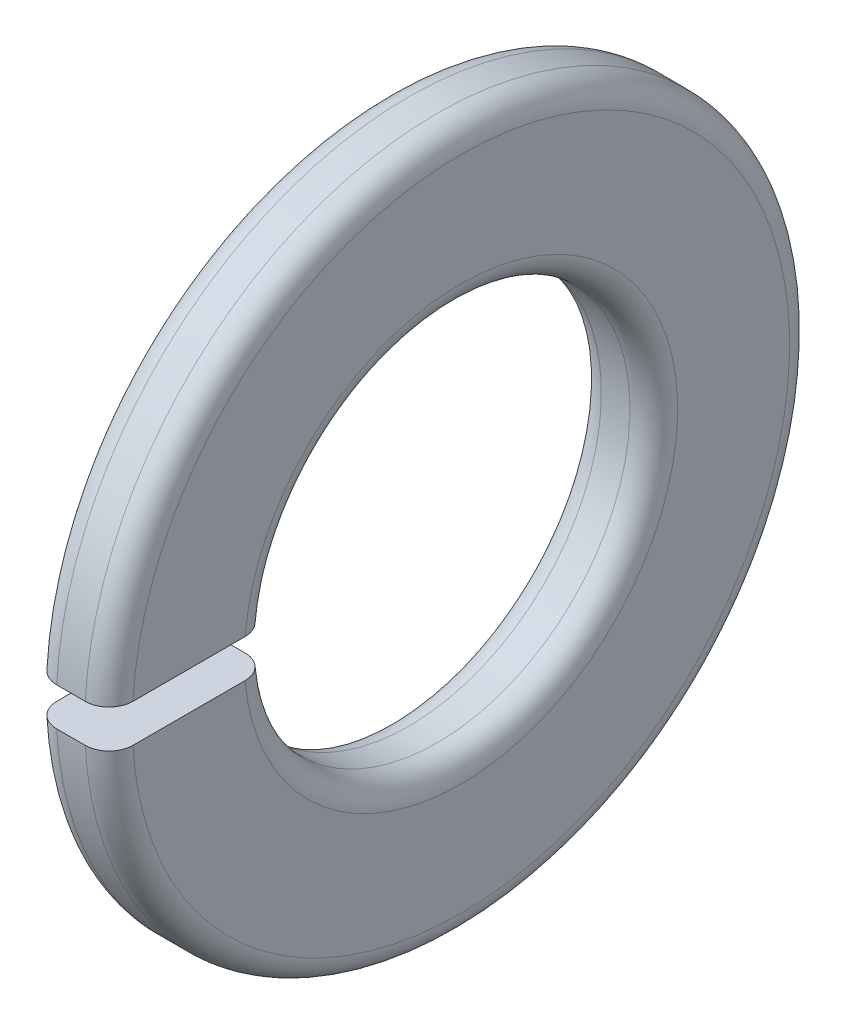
ISO-10303-21;
HEADER;
FILE_DESCRIPTION(('STEP AP214'),'2;1');
FILE_NAME('part.step','',(''),(''),'','','');
FILE_SCHEMA(('AUTOMOTIVE_DESIGN { 1 0 10303 214 1 1 1 1 }'));
ENDSEC;
DATA;
#1=APPLICATION_CONTEXT('core data for automotive mechanical design processes');
#2=APPLICATION_PROTOCOL_DEFINITION('international standard','automotive_design',2000,#1);
#3=PRODUCT_CONTEXT('',#1,'mechanical');
#4=PRODUCT('Part','Part','',(#3));
#5=PRODUCT_RELATED_PRODUCT_CATEGORY('part','',(#4));
#6=PRODUCT_DEFINITION_FORMATION('','',#4);
#7=PRODUCT_DEFINITION_CONTEXT('part definition',#1,'design');
#8=PRODUCT_DEFINITION('design','',#6,#7);
#9=PRODUCT_DEFINITION_SHAPE('','',#8);
#10=(LENGTH_UNIT() NAMED_UNIT(*) SI_UNIT(.MILLI.,.METRE.));
#11=(NAMED_UNIT(*) PLANE_ANGLE_UNIT() SI_UNIT($,.RADIAN.));
#12=(NAMED_UNIT(*) SI_UNIT($,.STERADIAN.) SOLID_ANGLE_UNIT());
#13=UNCERTAINTY_MEASURE_WITH_UNIT(LENGTH_MEASURE(1.E-05),#10,'distance_accuracy_value','');
#14=(GEOMETRIC_REPRESENTATION_CONTEXT(3) GLOBAL_UNCERTAINTY_ASSIGNED_CONTEXT((#13)) GLOBAL_UNIT_ASSIGNED_CONTEXT((#10,
#11,#12)) REPRESENTATION_CONTEXT('',''));
#15=CARTESIAN_POINT('',(0.,0.,0.));
#16=DIRECTION('',(0.,0.,1.));
#17=DIRECTION('',(1.,0.,0.));
#18=AXIS2_PLACEMENT_3D('',#15,#16,#17);
#19=CARTESIAN_POINT('',(-34.9249999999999,0.,0.));
#20=DIRECTION('',(-1.,0.,0.));
#21=DIRECTION('',(0.,0.,1.));
#22=AXIS2_PLACEMENT_3D('',#19,#20,#21);
#23=CYLINDRICAL_SURFACE('',#22,7.4);
#24=DIRECTION('',(-1.,0.,0.));
#25=VECTOR('',#24,1.);
#26=CARTESIAN_POINT('',(-34.9249999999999,0.4,7.38918128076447));
#27=LINE('',#26,#25);
#28=CARTESIAN_POINT('',(-0.5,0.4,7.38918128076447));
#29=VERTEX_POINT('',#28);
#30=CARTESIAN_POINT('',(-1.1,0.4,7.38918128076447));
#31=VERTEX_POINT('',#30);
#32=EDGE_CURVE('E189',#29,#31,#27,.T.);
#33=ORIENTED_EDGE('',*,*,#32,.F.);
#34=CARTESIAN_POINT('',(-0.5,0.,0.));
#35=DIRECTION('',(-1.,0.,0.));
#36=DIRECTION('',(0.,0.,1.));
#37=AXIS2_PLACEMENT_3D('',#34,#35,#36);
#38=CIRCLE('',#37,7.4);
#39=CARTESIAN_POINT('',(-0.5,-0.4,7.38918128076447));
#40=VERTEX_POINT('',#39);
#41=EDGE_CURVE('E137',#29,#40,#38,.T.);
#42=ORIENTED_EDGE('',*,*,#41,.T.);
#43=DIRECTION('',(-1.,0.,0.));
#44=VECTOR('',#43,1.);
#45=CARTESIAN_POINT('',(-34.9249999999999,-0.4,7.38918128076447));
#46=LINE('',#45,#44);
#47=CARTESIAN_POINT('',(-1.1,-0.4,7.38918128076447));
#48=VERTEX_POINT('',#47);
#49=EDGE_CURVE('E120',#48,#40,#46,.F.);
#50=ORIENTED_EDGE('',*,*,#49,.F.);
#51=CARTESIAN_POINT('',(-1.1,0.,0.));
#52=DIRECTION('',(1.,0.,0.));
#53=DIRECTION('',(0.,0.,-1.));
#54=AXIS2_PLACEMENT_3D('',#51,#52,#53);
#55=CIRCLE('',#54,7.4);
#56=EDGE_CURVE('E135',#48,#31,#55,.T.);
#57=ORIENTED_EDGE('',*,*,#56,.T.);
#58=EDGE_LOOP('',(#33,#42,#50,#57));
#59=FACE_BOUND('',#58,.T.);
#60=ADVANCED_FACE('F37',(#59),#23,.T.);
#61=CARTESIAN_POINT('',(0.,4.55,0.));
#62=DIRECTION('',(-1.,0.,0.));
#63=DIRECTION('',(0.,0.,1.));
#64=AXIS2_PLACEMENT_3D('',#61,#62,#63);
#65=PLANE('',#64);
#66=DIRECTION('',(0.,0.,1.));
#67=VECTOR('',#66,1.);
#68=CARTESIAN_POINT('',(0.,-0.4,0.));
#69=LINE('',#68,#67);
#70=CARTESIAN_POINT('',(0.,-0.4,4.53238347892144));
#71=VERTEX_POINT('',#70);
#72=CARTESIAN_POINT('',(0.,-0.4,6.88839603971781));
#73=VERTEX_POINT('',#72);
#74=EDGE_CURVE('E101',#71,#73,#69,.T.);
#75=ORIENTED_EDGE('',*,*,#74,.T.);
#76=CARTESIAN_POINT('',(0.,0.,0.));
#77=DIRECTION('',(-1.,0.,0.));
#78=DIRECTION('',(0.,0.,1.));
#79=AXIS2_PLACEMENT_3D('',#76,#77,#78);
#80=CIRCLE('',#79,6.9);
#81=CARTESIAN_POINT('',(0.,0.4,6.88839603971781));
#82=VERTEX_POINT('',#81);
#83=EDGE_CURVE('E59',#73,#82,#80,.F.);
#84=ORIENTED_EDGE('',*,*,#83,.T.);
#85=DIRECTION('',(0.,0.,-1.));
#86=VECTOR('',#85,1.);
#87=CARTESIAN_POINT('',(0.,0.4,7.548));
#88=LINE('',#87,#86);
#89=CARTESIAN_POINT('',(0.,0.4,4.53238347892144));
#90=VERTEX_POINT('',#89);
#91=EDGE_CURVE('E110',#82,#90,#88,.T.);
#92=ORIENTED_EDGE('',*,*,#91,.T.);
#93=CARTESIAN_POINT('',(0.,0.,0.));
#94=DIRECTION('',(-1.,0.,0.));
#95=DIRECTION('',(0.,0.,1.));
#96=AXIS2_PLACEMENT_3D('',#93,#94,#95);
#97=CIRCLE('',#96,4.55);
#98=EDGE_CURVE('E117',#90,#71,#97,.T.);
#99=ORIENTED_EDGE('',*,*,#98,.T.);
#100=EDGE_LOOP('',(#75,#84,#92,#99));
#101=FACE_BOUND('',#100,.T.);
#102=ADVANCED_FACE('F123',(#101),#65,.F.);
#103=CARTESIAN_POINT('',(-0.5,0.,0.));
#104=DIRECTION('',(-1.,0.,0.));
#105=DIRECTION('',(0.,0.,1.));
#106=AXIS2_PLACEMENT_3D('',#103,#104,#105);
#107=TOROIDAL_SURFACE('',#106,4.55,0.5);
#108=ORIENTED_EDGE('',*,*,#98,.F.);
#109=CARTESIAN_POINT('',(-0.330409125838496,0.4,4.05998263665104));
#110=CARTESIAN_POINT('',(-0.356699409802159,0.4,4.05045896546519));
#111=CARTESIAN_POINT('',(-0.383811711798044,0.4,4.04314572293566));
#112=CARTESIAN_POINT('',(-0.43890146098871,0.4,4.0331697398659));
#113=CARTESIAN_POINT('',(-0.466879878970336,0.4,4.03051242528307));
#114=CARTESIAN_POINT('',(-0.522875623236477,0.4,4.02993732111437));
#115=CARTESIAN_POINT('',(-0.550892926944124,0.4,4.0320174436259));
#116=CARTESIAN_POINT('',(-0.606172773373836,0.4,4.04085230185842));
#117=CARTESIAN_POINT('',(-0.633435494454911,0.4,4.04760592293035));
#118=CARTESIAN_POINT('',(-0.686443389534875,0.4,4.06558912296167));
#119=CARTESIAN_POINT('',(-0.712188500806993,0.4,4.07681888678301));
#120=CARTESIAN_POINT('',(-0.761436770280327,0.4,4.10342912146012));
#121=CARTESIAN_POINT('',(-0.784939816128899,0.4,4.11880980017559));
#122=CARTESIAN_POINT('',(-0.829113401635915,0.4,4.1533315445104));
#123=CARTESIAN_POINT('',(-0.849775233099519,0.4,4.17248375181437));
#124=CARTESIAN_POINT('',(-0.8876079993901,0.4,4.21397126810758));
#125=CARTESIAN_POINT('',(-0.904778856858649,0.4,4.23630664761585));
#126=CARTESIAN_POINT('',(-0.93522366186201,0.4,4.28363431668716));
#127=CARTESIAN_POINT('',(-0.948479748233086,0.4,4.30863809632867));
#128=CARTESIAN_POINT('',(-0.970623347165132,0.4,4.36051051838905));
#129=CARTESIAN_POINT('',(-0.979510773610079,0.4,4.38737919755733));
#130=CARTESIAN_POINT('',(-0.992694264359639,0.4,4.44232245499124));
#131=CARTESIAN_POINT('',(-0.996973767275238,0.4,4.4704010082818));
#132=CARTESIAN_POINT('',(-1.00076411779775,0.4,4.52687835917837));
#133=CARTESIAN_POINT('',(-1.0002749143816,0.4,4.55527716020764));
#134=CARTESIAN_POINT('',(-0.994535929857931,0.4,4.61162260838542));
#135=CARTESIAN_POINT('',(-0.989280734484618,0.4,4.63956870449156));
#136=CARTESIAN_POINT('',(-0.974146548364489,0.4,4.69417974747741));
#137=CARTESIAN_POINT('',(-0.96426758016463,0.4,4.72084470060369));
#138=CARTESIAN_POINT('',(-0.940178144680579,0.4,4.77209438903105));
#139=CARTESIAN_POINT('',(-0.925973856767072,0.4,4.79668202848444));
#140=CARTESIAN_POINT('',(-0.893627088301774,0.4,4.84311401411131));
#141=CARTESIAN_POINT('',(-0.875484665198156,0.4,4.8649584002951));
#142=CARTESIAN_POINT('',(-0.835834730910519,0.4,4.90521248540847));
#143=CARTESIAN_POINT('',(-0.814337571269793,0.4,4.92363238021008));
#144=CARTESIAN_POINT('',(-0.768547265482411,0.4,4.95658736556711));
#145=CARTESIAN_POINT('',(-0.744254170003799,0.4,4.97112252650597));
#146=CARTESIAN_POINT('',(-0.693647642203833,0.4,4.99584577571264));
#147=CARTESIAN_POINT('',(-0.667341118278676,0.4,5.00604800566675));
#148=CARTESIAN_POINT('',(-0.613386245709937,0.4,5.02187927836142));
#149=CARTESIAN_POINT('',(-0.585737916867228,0.4,5.0275083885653));
#150=CARTESIAN_POINT('',(-0.529954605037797,0.4,5.03402249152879));
#151=CARTESIAN_POINT('',(-0.501820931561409,0.4,5.03491870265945));
#152=CARTESIAN_POINT('',(-0.445803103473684,0.4,5.03197138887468));
#153=CARTESIAN_POINT('',(-0.417918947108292,0.4,5.0281278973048));
#154=CARTESIAN_POINT('',(-0.363212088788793,0.4,5.01581674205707));
#155=CARTESIAN_POINT('',(-0.336388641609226,0.4,5.00735238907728));
#156=CARTESIAN_POINT('',(-0.284541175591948,0.4,4.98604553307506));
#157=CARTESIAN_POINT('',(-0.259517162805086,0.4,4.97320301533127));
#158=CARTESIAN_POINT('',(-0.211946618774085,0.4,4.94349125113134));
#159=CARTESIAN_POINT('',(-0.189402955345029,0.4,4.92661741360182));
#160=CARTESIAN_POINT('',(-0.147459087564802,0.4,4.88933373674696));
#161=CARTESIAN_POINT('',(-0.128058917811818,0.4,4.86892385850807));
#162=CARTESIAN_POINT('',(-0.092896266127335,0.4,4.82509033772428));
#163=CARTESIAN_POINT('',(-0.0771436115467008,0.4,4.8016588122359));
#164=CARTESIAN_POINT('',(-0.0497804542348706,0.4,4.75249065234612));
#165=CARTESIAN_POINT('',(-0.0381700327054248,0.4,4.72675397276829));
#166=CARTESIAN_POINT('',(-0.0193802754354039,0.4,4.67361422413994));
#167=CARTESIAN_POINT('',(-0.0122158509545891,0.4,4.64620588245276));
#168=CARTESIAN_POINT('',(-0.00257598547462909,0.4,4.59057656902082));
#169=CARTESIAN_POINT('',(-0.000100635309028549,0.4,4.56235558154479));
#170=CARTESIAN_POINT('',(9.48808271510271E-05,0.4,4.50581794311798));
#171=CARTESIAN_POINT('',(-0.00219827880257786,0.4,4.47750124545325));
#172=CARTESIAN_POINT('',(-0.0115011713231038,0.4,4.42165438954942));
#173=CARTESIAN_POINT('',(-0.0185107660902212,0.4,4.39412420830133));
#174=CARTESIAN_POINT('',(-0.0370577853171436,0.4,4.3406085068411));
#175=CARTESIAN_POINT('',(-0.0485988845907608,0.4,4.31462426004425));
#176=CARTESIAN_POINT('',(-0.0758904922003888,0.4,4.26495974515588));
#177=CARTESIAN_POINT('',(-0.0916420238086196,0.4,4.2412800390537));
#178=CARTESIAN_POINT('',(-0.12688551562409,0.4,4.19694238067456));
#179=CARTESIAN_POINT('',(-0.146372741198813,0.4,4.17628066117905));
#180=CARTESIAN_POINT('',(-0.188537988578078,0.4,4.13855872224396));
#181=CARTESIAN_POINT('',(-0.211212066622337,0.4,4.12149411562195));
#182=CARTESIAN_POINT('',(-0.250142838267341,0.4,4.09706335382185));
#183=CARTESIAN_POINT('',(-0.265634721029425,0.4,4.08845497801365));
#184=CARTESIAN_POINT('',(-0.297444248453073,0.4,4.07292985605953));
#185=CARTESIAN_POINT('',(-0.313761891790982,0.4,4.06601310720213));
#186=CARTESIAN_POINT('',(-0.330409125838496,0.4,4.05998263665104));
#187=B_SPLINE_CURVE_WITH_KNOTS('',3,(#109,#110,#111,#112,#113,#114,#115,#116,#117,#118,#119,
#120,#121,#122,#123,#124,#125,#126,#127,#128,#129,#130,#131,#132,#133,#134,#135,#136,#137,#138,
#139,#140,#141,#142,#143,#144,#145,#146,#147,#148,#149,#150,#151,#152,#153,#154,#155,#156,#157,
#158,#159,#160,#161,#162,#163,#164,#165,#166,#167,#168,#169,#170,#171,#172,#173,#174,#175,#176,
#177,#178,#179,#180,#181,#182,#183,#184,#185,#186),.UNSPECIFIED.,.T.,.F.,(4,2,2,2,2,2,2,2,2,2,2,
2,2,2,2,2,2,2,2,2,2,2,2,2,2,2,2,2,2,2,2,2,2,2,2,2,2,2,4),(0.,0.0838218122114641,
0.167741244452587,0.251623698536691,0.335486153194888,0.41935207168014,0.503222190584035,
0.587343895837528,0.671467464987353,0.755969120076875,0.840472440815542,0.92527847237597,
1.0100854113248,1.09498881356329,1.17989180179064,1.26467405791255,1.34945507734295,
1.43397948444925,1.51850236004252,1.60274721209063,1.68699082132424,1.77103465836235,
1.85507790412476,1.93906101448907,2.02304440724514,2.10712390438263,2.19120432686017,
2.27550871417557,2.35981475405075,2.44440203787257,2.52899096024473,2.61381658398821,
2.69863972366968,2.78353179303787,2.8684445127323,2.95325031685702,3.03795208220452,
3.0910288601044,3.14410555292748),.UNSPECIFIED.);
#188=CARTESIAN_POINT('',(-0.5,0.4,4.03019850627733));
#189=VERTEX_POINT('',#188);
#190=EDGE_CURVE('E184',#90,#189,#187,.T.);
#191=ORIENTED_EDGE('',*,*,#190,.T.);
#192=CARTESIAN_POINT('',(-0.5,0.,0.));
#193=DIRECTION('',(-1.,0.,0.));
#194=DIRECTION('',(0.,0.,1.));
#195=AXIS2_PLACEMENT_3D('',#192,#193,#194);
#196=CIRCLE('',#195,4.05);
#197=CARTESIAN_POINT('',(-0.5,-0.4,4.03019850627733));
#198=VERTEX_POINT('',#197);
#199=EDGE_CURVE('E119',#189,#198,#196,.T.);
#200=ORIENTED_EDGE('',*,*,#199,.T.);
#201=CARTESIAN_POINT('',(-0.330409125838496,-0.4,4.05998263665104));
#202=CARTESIAN_POINT('',(-0.30399805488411,-0.4,4.06955274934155));
#203=CARTESIAN_POINT('',(-0.27837818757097,-0.4,4.08136780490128));
#204=CARTESIAN_POINT('',(-0.229468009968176,-0.4,4.10914708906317));
#205=CARTESIAN_POINT('',(-0.206180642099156,-0.4,4.12511646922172));
#206=CARTESIAN_POINT('',(-0.162628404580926,-0.4,4.16072554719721));
#207=CARTESIAN_POINT('',(-0.142361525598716,-0.4,4.18036278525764));
#208=CARTESIAN_POINT('',(-0.10540486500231,-0.4,4.22274546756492));
#209=CARTESIAN_POINT('',(-0.0887142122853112,-0.4,4.24549015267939));
#210=CARTESIAN_POINT('',(-0.059314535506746,-0.4,4.29352811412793));
#211=CARTESIAN_POINT('',(-0.0466191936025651,-0.4,4.31882976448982));
#212=CARTESIAN_POINT('',(-0.0256391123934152,-0.4,4.37120120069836));
#213=CARTESIAN_POINT('',(-0.017354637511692,-0.4,4.39827109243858));
#214=CARTESIAN_POINT('',(-0.00540643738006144,-0.4,4.45350983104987));
#215=CARTESIAN_POINT('',(-0.00175868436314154,-0.4,4.48168213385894));
#216=CARTESIAN_POINT('',(0.000760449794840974,-0.4,4.53823962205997));
#217=CARTESIAN_POINT('',(-0.000368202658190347,-0.4,4.56662480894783));
#218=CARTESIAN_POINT('',(-0.00737611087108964,-0.4,4.62283053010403));
#219=CARTESIAN_POINT('',(-0.0132599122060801,-0.4,4.6506504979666));
#220=CARTESIAN_POINT('',(-0.0296218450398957,-0.4,4.70490507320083));
#221=CARTESIAN_POINT('',(-0.0400999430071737,-0.4,4.73133969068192));
#222=CARTESIAN_POINT('',(-0.0653384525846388,-0.4,4.7820273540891));
#223=CARTESIAN_POINT('',(-0.0800921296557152,-0.4,4.80628375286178));
#224=CARTESIAN_POINT('',(-0.113474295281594,-0.4,4.85196527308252));
#225=CARTESIAN_POINT('',(-0.132102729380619,-0.4,4.87339043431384));
#226=CARTESIAN_POINT('',(-0.172644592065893,-0.4,4.91273005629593));
#227=CARTESIAN_POINT('',(-0.194547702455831,-0.4,4.93065515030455));
#228=CARTESIAN_POINT('',(-0.2410606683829,-0.4,4.96255932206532));
#229=CARTESIAN_POINT('',(-0.265670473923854,-0.4,4.97653847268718));
#230=CARTESIAN_POINT('',(-0.316811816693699,-0.4,5.00010680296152));
#231=CARTESIAN_POINT('',(-0.343336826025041,-0.4,5.00971014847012));
#232=CARTESIAN_POINT('',(-0.397624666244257,-0.4,5.02431588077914));
#233=CARTESIAN_POINT('',(-0.42538747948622,-0.4,5.0293183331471));
#234=CARTESIAN_POINT('',(-0.481295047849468,-0.4,5.03457129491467));
#235=CARTESIAN_POINT('',(-0.509438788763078,-0.4,5.03483260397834));
#236=CARTESIAN_POINT('',(-0.565370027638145,-0.4,5.03062343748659));
#237=CARTESIAN_POINT('',(-0.59315752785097,-0.4,5.02615299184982));
#238=CARTESIAN_POINT('',(-0.647570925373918,-0.4,5.01261353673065));
#239=CARTESIAN_POINT('',(-0.674197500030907,-0.4,5.00354724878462));
#240=CARTESIAN_POINT('',(-0.725553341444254,-0.4,4.98107859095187));
#241=CARTESIAN_POINT('',(-0.750282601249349,-0.4,4.96767620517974));
#242=CARTESIAN_POINT('',(-0.797176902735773,-0.4,4.93690019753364));
#243=CARTESIAN_POINT('',(-0.819338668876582,-0.4,4.91952158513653));
#244=CARTESIAN_POINT('',(-0.860439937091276,-0.4,4.88129967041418));
#245=CARTESIAN_POINT('',(-0.879379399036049,-0.4,4.86045632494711));
#246=CARTESIAN_POINT('',(-0.913555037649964,-0.4,4.81583644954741));
#247=CARTESIAN_POINT('',(-0.928780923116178,-0.4,4.79205203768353));
#248=CARTESIAN_POINT('',(-0.955038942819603,-0.4,4.74227124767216));
#249=CARTESIAN_POINT('',(-0.966071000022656,-0.4,4.71627482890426));
#250=CARTESIAN_POINT('',(-0.983666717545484,-0.4,4.66271495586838));
#251=CARTESIAN_POINT('',(-0.990215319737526,-0.4,4.63514655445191));
#252=CARTESIAN_POINT('',(-0.998605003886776,-0.4,4.57930250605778));
#253=CARTESIAN_POINT('',(-1.00044600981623,-0.4,4.55102684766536));
#254=CARTESIAN_POINT('',(-0.99937012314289,-0.4,4.49448976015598));
#255=CARTESIAN_POINT('',(-0.996440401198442,-0.4,4.46622857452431));
#256=CARTESIAN_POINT('',(-0.985881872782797,-0.4,4.41059778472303));
#257=CARTESIAN_POINT('',(-0.978253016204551,-0.4,4.38322819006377));
#258=CARTESIAN_POINT('',(-0.958501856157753,-0.4,4.33013753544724));
#259=CARTESIAN_POINT('',(-0.946376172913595,-0.4,4.30441773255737));
#260=CARTESIAN_POINT('',(-0.917971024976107,-0.4,4.25538396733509));
#261=CARTESIAN_POINT('',(-0.901691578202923,-0.4,4.23206999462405));
#262=CARTESIAN_POINT('',(-0.865470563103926,-0.4,4.18856023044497));
#263=CARTESIAN_POINT('',(-0.84553600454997,-0.4,4.16835860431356));
#264=CARTESIAN_POINT('',(-0.802546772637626,-0.4,4.13160624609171));
#265=CARTESIAN_POINT('',(-0.779492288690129,-0.4,4.11505529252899));
#266=CARTESIAN_POINT('',(-0.731019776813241,-0.4,4.08614782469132));
#267=CARTESIAN_POINT('',(-0.705612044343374,-0.4,4.07377404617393));
#268=CARTESIAN_POINT('',(-0.653066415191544,-0.4,4.05348603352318));
#269=CARTESIAN_POINT('',(-0.625928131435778,-0.4,4.04557280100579));
#270=CARTESIAN_POINT('',(-0.570813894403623,-0.4,4.0344647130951));
#271=CARTESIAN_POINT('',(-0.54284155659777,-0.4,4.03125186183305));
#272=CARTESIAN_POINT('',(-0.486779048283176,-0.4,4.02958609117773));
#273=CARTESIAN_POINT('',(-0.45868906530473,-0.4,4.03112731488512));
#274=CARTESIAN_POINT('',(-0.41381377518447,-0.4,4.03741323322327));
#275=CARTESIAN_POINT('',(-0.396812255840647,-0.4,4.04070793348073));
#276=CARTESIAN_POINT('',(-0.363243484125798,-0.4,4.04904542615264));
#277=CARTESIAN_POINT('',(-0.346676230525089,-0.4,4.05408821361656));
#278=CARTESIAN_POINT('',(-0.330409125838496,-0.4,4.05998263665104));
#279=B_SPLINE_CURVE_WITH_KNOTS('',3,(#201,#202,#203,#204,#205,#206,#207,#208,#209,#210,#211,
#212,#213,#214,#215,#216,#217,#218,#219,#220,#221,#222,#223,#224,#225,#226,#227,#228,#229,#230,
#231,#232,#233,#234,#235,#236,#237,#238,#239,#240,#241,#242,#243,#244,#245,#246,#247,#248,#249,
#250,#251,#252,#253,#254,#255,#256,#257,#258,#259,#260,#261,#262,#263,#264,#265,#266,#267,#268,
#269,#270,#271,#272,#273,#274,#275,#276,#277,#278),.UNSPECIFIED.,.T.,.F.,(4,2,2,2,2,2,2,2,2,2,2,
2,2,2,2,2,2,2,2,2,2,2,2,2,2,2,2,2,2,2,2,2,2,2,2,2,2,2,4),(0.,0.084210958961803,
0.168526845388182,0.252786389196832,0.337025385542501,0.421549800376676,0.506079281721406,
0.59089916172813,0.675719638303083,0.760621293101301,0.845522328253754,0.930290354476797,
1.01505718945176,1.09956235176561,1.18406595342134,1.26829401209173,1.35252087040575,
1.43655584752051,1.52059029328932,1.60457503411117,1.68856008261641,1.77265112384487,
1.8567432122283,1.94106575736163,2.02538985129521,2.10999578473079,2.19460308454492,
2.2794382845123,2.36427438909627,2.44917438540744,2.53407401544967,2.61881249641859,
2.7035458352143,2.78792455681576,2.87232221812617,2.95639590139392,3.04036604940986,
3.09223340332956,3.14410061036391),.UNSPECIFIED.);
#280=EDGE_CURVE('E105',#198,#71,#279,.T.);
#281=ORIENTED_EDGE('',*,*,#280,.T.);
#282=EDGE_LOOP('',(#108,#191,#200,#281));
#283=FACE_BOUND('',#282,.T.);
#284=ADVANCED_FACE('F115',(#283),#107,.T.);
#285=CARTESIAN_POINT('',(-34.9249999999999,0.,0.));
#286=DIRECTION('',(-1.,0.,0.));
#287=DIRECTION('',(0.,0.,1.));
#288=AXIS2_PLACEMENT_3D('',#285,#286,#287);
#289=CYLINDRICAL_SURFACE('',#288,4.05);
#290=DIRECTION('',(-1.,0.,0.));
#291=VECTOR('',#290,1.);
#292=CARTESIAN_POINT('',(-34.9249999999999,0.4,4.03019850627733));
#293=LINE('',#292,#291);
#294=CARTESIAN_POINT('',(-1.1,0.4,4.03019850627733));
#295=VERTEX_POINT('',#294);
#296=EDGE_CURVE('E190',#295,#189,#293,.F.);
#297=ORIENTED_EDGE('',*,*,#296,.F.);
#298=CARTESIAN_POINT('',(-1.1,0.,0.));
#299=DIRECTION('',(-1.,0.,0.));
#300=DIRECTION('',(0.,0.,1.));
#301=AXIS2_PLACEMENT_3D('',#298,#299,#300);
#302=CIRCLE('',#301,4.05);
#303=CARTESIAN_POINT('',(-1.1,-0.4,4.03019850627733));
#304=VERTEX_POINT('',#303);
#305=EDGE_CURVE('E130',#295,#304,#302,.T.);
#306=ORIENTED_EDGE('',*,*,#305,.T.);
#307=DIRECTION('',(-1.,0.,0.));
#308=VECTOR('',#307,1.);
#309=CARTESIAN_POINT('',(-34.9249999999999,-0.4,4.03019850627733));
#310=LINE('',#309,#308);
#311=EDGE_CURVE('E121',#198,#304,#310,.T.);
#312=ORIENTED_EDGE('',*,*,#311,.F.);
#313=ORIENTED_EDGE('',*,*,#199,.F.);
#314=EDGE_LOOP('',(#297,#306,#312,#313));
#315=FACE_BOUND('',#314,.T.);
#316=ADVANCED_FACE('F195',(#315),#289,.F.);
#317=CARTESIAN_POINT('',(-1.1,0.,0.));
#318=DIRECTION('',(-1.,0.,0.));
#319=DIRECTION('',(0.,0.,1.));
#320=AXIS2_PLACEMENT_3D('',#317,#318,#319);
#321=TOROIDAL_SURFACE('',#320,4.55,0.5);
#322=ORIENTED_EDGE('',*,*,#305,.F.);
#323=CARTESIAN_POINT('',(-1.2695908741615,0.4,4.05998263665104));
#324=CARTESIAN_POINT('',(-1.29600194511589,0.4,4.06955274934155));
#325=CARTESIAN_POINT('',(-1.32162181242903,0.4,4.08136780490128));
#326=CARTESIAN_POINT('',(-1.37053199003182,0.4,4.10914708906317));
#327=CARTESIAN_POINT('',(-1.39381935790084,0.4,4.12511646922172));
#328=CARTESIAN_POINT('',(-1.43737159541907,0.4,4.16072554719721));
#329=CARTESIAN_POINT('',(-1.45763847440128,0.4,4.18036278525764));
#330=CARTESIAN_POINT('',(-1.49459513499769,0.4,4.22274546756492));
#331=CARTESIAN_POINT('',(-1.51128578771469,0.4,4.24549015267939));
#332=CARTESIAN_POINT('',(-1.54068546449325,0.4,4.29352811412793));
#333=CARTESIAN_POINT('',(-1.55338080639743,0.4,4.31882976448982));
#334=CARTESIAN_POINT('',(-1.57436088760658,0.4,4.37120120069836));
#335=CARTESIAN_POINT('',(-1.58264536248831,0.4,4.39827109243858));
#336=CARTESIAN_POINT('',(-1.59459356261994,0.4,4.45350983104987));
#337=CARTESIAN_POINT('',(-1.59824131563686,0.4,4.48168213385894));
#338=CARTESIAN_POINT('',(-1.60076044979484,0.4,4.53823962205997));
#339=CARTESIAN_POINT('',(-1.59963179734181,0.4,4.56662480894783));
#340=CARTESIAN_POINT('',(-1.59262388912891,0.4,4.62283053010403));
#341=CARTESIAN_POINT('',(-1.58674008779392,0.4,4.6506504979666));
#342=CARTESIAN_POINT('',(-1.5703781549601,0.4,4.70490507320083));
#343=CARTESIAN_POINT('',(-1.55990005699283,0.4,4.73133969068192));
#344=CARTESIAN_POINT('',(-1.53466154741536,0.4,4.7820273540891));
#345=CARTESIAN_POINT('',(-1.51990787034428,0.4,4.80628375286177));
#346=CARTESIAN_POINT('',(-1.48652570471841,0.4,4.85196527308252));
#347=CARTESIAN_POINT('',(-1.46789727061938,0.4,4.87339043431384));
#348=CARTESIAN_POINT('',(-1.42735540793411,0.4,4.91273005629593));
#349=CARTESIAN_POINT('',(-1.40545229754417,0.4,4.93065515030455));
#350=CARTESIAN_POINT('',(-1.3589393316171,0.4,4.96255932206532));
#351=CARTESIAN_POINT('',(-1.33432952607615,0.4,4.97653847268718));
#352=CARTESIAN_POINT('',(-1.2831881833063,0.4,5.00010680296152));
#353=CARTESIAN_POINT('',(-1.25666317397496,0.4,5.00971014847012));
#354=CARTESIAN_POINT('',(-1.20237533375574,0.4,5.02431588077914));
#355=CARTESIAN_POINT('',(-1.17461252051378,0.4,5.0293183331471));
#356=CARTESIAN_POINT('',(-1.11870495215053,0.4,5.03457129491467));
#357=CARTESIAN_POINT('',(-1.09056121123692,0.4,5.03483260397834));
#358=CARTESIAN_POINT('',(-1.03462997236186,0.4,5.03062343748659));
#359=CARTESIAN_POINT('',(-1.00684247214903,0.4,5.02615299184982));
#360=CARTESIAN_POINT('',(-0.952429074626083,0.4,5.01261353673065));
#361=CARTESIAN_POINT('',(-0.925802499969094,0.4,5.00354724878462));
#362=CARTESIAN_POINT('',(-0.874446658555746,0.4,4.98107859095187));
#363=CARTESIAN_POINT('',(-0.849717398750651,0.4,4.96767620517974));
#364=CARTESIAN_POINT('',(-0.802823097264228,0.4,4.93690019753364));
#365=CARTESIAN_POINT('',(-0.780661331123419,0.4,4.91952158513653));
#366=CARTESIAN_POINT('',(-0.739560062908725,0.4,4.88129967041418));
#367=CARTESIAN_POINT('',(-0.720620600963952,0.4,4.86045632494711));
#368=CARTESIAN_POINT('',(-0.686444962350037,0.4,4.81583644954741));
#369=CARTESIAN_POINT('',(-0.671219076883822,0.4,4.79205203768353));
#370=CARTESIAN_POINT('',(-0.644961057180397,0.4,4.74227124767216));
#371=CARTESIAN_POINT('',(-0.633928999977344,0.4,4.71627482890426));
#372=CARTESIAN_POINT('',(-0.616333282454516,0.4,4.66271495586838));
#373=CARTESIAN_POINT('',(-0.609784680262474,0.4,4.63514655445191));
#374=CARTESIAN_POINT('',(-0.601394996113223,0.4,4.57930250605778));
#375=CARTESIAN_POINT('',(-0.59955399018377,0.4,4.55102684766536));
#376=CARTESIAN_POINT('',(-0.600629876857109,0.4,4.49448976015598));
#377=CARTESIAN_POINT('',(-0.603559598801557,0.4,4.46622857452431));
#378=CARTESIAN_POINT('',(-0.614118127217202,0.4,4.41059778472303));
#379=CARTESIAN_POINT('',(-0.621746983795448,0.4,4.38322819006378));
#380=CARTESIAN_POINT('',(-0.641498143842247,0.4,4.33013753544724));
#381=CARTESIAN_POINT('',(-0.653623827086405,0.4,4.30441773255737));
#382=CARTESIAN_POINT('',(-0.682028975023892,0.4,4.25538396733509));
#383=CARTESIAN_POINT('',(-0.698308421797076,0.4,4.23206999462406));
#384=CARTESIAN_POINT('',(-0.734529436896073,0.4,4.18856023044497));
#385=CARTESIAN_POINT('',(-0.754463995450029,0.4,4.16835860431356));
#386=CARTESIAN_POINT('',(-0.797453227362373,0.4,4.13160624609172));
#387=CARTESIAN_POINT('',(-0.820507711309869,0.4,4.11505529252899));
#388=CARTESIAN_POINT('',(-0.868980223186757,0.4,4.08614782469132));
#389=CARTESIAN_POINT('',(-0.894387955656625,0.4,4.07377404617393));
#390=CARTESIAN_POINT('',(-0.946933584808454,0.4,4.05348603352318));
#391=CARTESIAN_POINT('',(-0.97407186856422,0.4,4.0455728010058));
#392=CARTESIAN_POINT('',(-1.02918610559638,0.4,4.0344647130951));
#393=CARTESIAN_POINT('',(-1.05715844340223,0.4,4.03125186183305));
#394=CARTESIAN_POINT('',(-1.11322095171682,0.4,4.02958609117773));
#395=CARTESIAN_POINT('',(-1.14131093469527,0.4,4.03112731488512));
#396=CARTESIAN_POINT('',(-1.18618622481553,0.4,4.03741323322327));
#397=CARTESIAN_POINT('',(-1.20318774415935,0.4,4.04070793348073));
#398=CARTESIAN_POINT('',(-1.2367565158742,0.4,4.04904542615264));
#399=CARTESIAN_POINT('',(-1.25332376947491,0.4,4.05408821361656));
#400=CARTESIAN_POINT('',(-1.2695908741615,0.4,4.05998263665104));
#401=B_SPLINE_CURVE_WITH_KNOTS('',3,(#323,#324,#325,#326,#327,#328,#329,#330,#331,#332,#333,
#334,#335,#336,#337,#338,#339,#340,#341,#342,#343,#344,#345,#346,#347,#348,#349,#350,#351,#352,
#353,#354,#355,#356,#357,#358,#359,#360,#361,#362,#363,#364,#365,#366,#367,#368,#369,#370,#371,
#372,#373,#374,#375,#376,#377,#378,#379,#380,#381,#382,#383,#384,#385,#386,#387,#388,#389,#390,
#391,#392,#393,#394,#395,#396,#397,#398,#399,#400),.UNSPECIFIED.,.T.,.F.,(4,2,2,2,2,2,2,2,2,2,2,
2,2,2,2,2,2,2,2,2,2,2,2,2,2,2,2,2,2,2,2,2,2,2,2,2,2,2,4),(0.,0.0842109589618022,
0.168526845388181,0.252786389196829,0.337025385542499,0.421549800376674,0.506079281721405,
0.590899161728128,0.675719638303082,0.760621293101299,0.845522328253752,0.930290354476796,
1.01505718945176,1.0995623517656,1.18406595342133,1.26829401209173,1.35252087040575,
1.43655584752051,1.52059029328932,1.60457503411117,1.6885600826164,1.77265112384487,
1.8567432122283,1.94106575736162,2.02538985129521,2.10999578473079,2.19460308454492,
2.2794382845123,2.36427438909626,2.44917438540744,2.53407401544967,2.61881249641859,
2.70354583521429,2.78792455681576,2.87232221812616,2.95639590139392,3.04036604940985,
3.09223340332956,3.14410061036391),.UNSPECIFIED.);
#402=CARTESIAN_POINT('',(-1.6,0.4,4.53238347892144));
#403=VERTEX_POINT('',#402);
#404=EDGE_CURVE('E177',#295,#403,#401,.T.);
#405=ORIENTED_EDGE('',*,*,#404,.T.);
#406=CARTESIAN_POINT('',(-1.6,0.,0.));
#407=DIRECTION('',(-1.,0.,0.));
#408=DIRECTION('',(0.,0.,1.));
#409=AXIS2_PLACEMENT_3D('',#406,#407,#408);
#410=CIRCLE('',#409,4.55);
#411=CARTESIAN_POINT('',(-1.6,-0.4,4.53238347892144));
#412=VERTEX_POINT('',#411);
#413=EDGE_CURVE('E231',#403,#412,#410,.T.);
#414=ORIENTED_EDGE('',*,*,#413,.T.);
#415=CARTESIAN_POINT('',(-1.2695908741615,-0.4,4.05998263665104));
#416=CARTESIAN_POINT('',(-1.24330059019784,-0.4,4.05045896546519));
#417=CARTESIAN_POINT('',(-1.21618828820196,-0.4,4.04314572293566));
#418=CARTESIAN_POINT('',(-1.16109853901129,-0.4,4.0331697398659));
#419=CARTESIAN_POINT('',(-1.13312012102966,-0.4,4.03051242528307));
#420=CARTESIAN_POINT('',(-1.07712437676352,-0.4,4.02993732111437));
#421=CARTESIAN_POINT('',(-1.04910707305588,-0.4,4.0320174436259));
#422=CARTESIAN_POINT('',(-0.993827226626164,-0.4,4.04085230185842));
#423=CARTESIAN_POINT('',(-0.966564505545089,-0.4,4.04760592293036));
#424=CARTESIAN_POINT('',(-0.913556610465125,-0.4,4.06558912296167));
#425=CARTESIAN_POINT('',(-0.887811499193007,-0.4,4.07681888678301));
#426=CARTESIAN_POINT('',(-0.838563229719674,-0.4,4.10342912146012));
#427=CARTESIAN_POINT('',(-0.815060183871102,-0.4,4.11880980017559));
#428=CARTESIAN_POINT('',(-0.770886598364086,-0.4,4.1533315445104));
#429=CARTESIAN_POINT('',(-0.750224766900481,-0.4,4.17248375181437));
#430=CARTESIAN_POINT('',(-0.7123920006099,-0.4,4.21397126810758));
#431=CARTESIAN_POINT('',(-0.695221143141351,-0.4,4.23630664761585));
#432=CARTESIAN_POINT('',(-0.66477633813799,-0.4,4.28363431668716));
#433=CARTESIAN_POINT('',(-0.651520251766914,-0.4,4.30863809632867));
#434=CARTESIAN_POINT('',(-0.629376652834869,-0.4,4.36051051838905));
#435=CARTESIAN_POINT('',(-0.620489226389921,-0.4,4.38737919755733));
#436=CARTESIAN_POINT('',(-0.607305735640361,-0.4,4.44232245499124));
#437=CARTESIAN_POINT('',(-0.603026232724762,-0.4,4.4704010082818));
#438=CARTESIAN_POINT('',(-0.599235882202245,-0.4,4.52687835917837));
#439=CARTESIAN_POINT('',(-0.599725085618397,-0.4,4.55527716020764));
#440=CARTESIAN_POINT('',(-0.605464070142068,-0.4,4.61162260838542));
#441=CARTESIAN_POINT('',(-0.610719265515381,-0.4,4.63956870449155));
#442=CARTESIAN_POINT('',(-0.625853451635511,-0.4,4.69417974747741));
#443=CARTESIAN_POINT('',(-0.635732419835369,-0.4,4.72084470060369));
#444=CARTESIAN_POINT('',(-0.659821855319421,-0.4,4.77209438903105));
#445=CARTESIAN_POINT('',(-0.674026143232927,-0.4,4.79668202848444));
#446=CARTESIAN_POINT('',(-0.706372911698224,-0.4,4.84311401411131));
#447=CARTESIAN_POINT('',(-0.724515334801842,-0.4,4.8649584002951));
#448=CARTESIAN_POINT('',(-0.76416526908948,-0.4,4.90521248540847));
#449=CARTESIAN_POINT('',(-0.785662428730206,-0.4,4.92363238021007));
#450=CARTESIAN_POINT('',(-0.831452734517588,-0.4,4.95658736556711));
#451=CARTESIAN_POINT('',(-0.855745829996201,-0.4,4.97112252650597));
#452=CARTESIAN_POINT('',(-0.906352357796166,-0.4,4.99584577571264));
#453=CARTESIAN_POINT('',(-0.932658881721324,-0.4,5.00604800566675));
#454=CARTESIAN_POINT('',(-0.986613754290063,-0.4,5.02187927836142));
#455=CARTESIAN_POINT('',(-1.01426208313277,-0.4,5.0275083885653));
#456=CARTESIAN_POINT('',(-1.0700453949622,-0.4,5.03402249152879));
#457=CARTESIAN_POINT('',(-1.09817906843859,-0.4,5.03491870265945));
#458=CARTESIAN_POINT('',(-1.15419689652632,-0.4,5.03197138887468));
#459=CARTESIAN_POINT('',(-1.18208105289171,-0.4,5.0281278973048));
#460=CARTESIAN_POINT('',(-1.23678791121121,-0.4,5.01581674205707));
#461=CARTESIAN_POINT('',(-1.26361135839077,-0.4,5.00735238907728));
#462=CARTESIAN_POINT('',(-1.31545882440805,-0.4,4.98604553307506));
#463=CARTESIAN_POINT('',(-1.34048283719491,-0.4,4.97320301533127));
#464=CARTESIAN_POINT('',(-1.38805338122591,-0.4,4.94349125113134));
#465=CARTESIAN_POINT('',(-1.41059704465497,-0.4,4.92661741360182));
#466=CARTESIAN_POINT('',(-1.4525409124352,-0.4,4.88933373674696));
#467=CARTESIAN_POINT('',(-1.47194108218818,-0.4,4.86892385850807));
#468=CARTESIAN_POINT('',(-1.50710373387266,-0.4,4.82509033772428));
#469=CARTESIAN_POINT('',(-1.5228563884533,-0.4,4.8016588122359));
#470=CARTESIAN_POINT('',(-1.55021954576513,-0.4,4.75249065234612));
#471=CARTESIAN_POINT('',(-1.56182996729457,-0.4,4.72675397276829));
#472=CARTESIAN_POINT('',(-1.5806197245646,-0.4,4.67361422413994));
#473=CARTESIAN_POINT('',(-1.58778414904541,-0.4,4.64620588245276));
#474=CARTESIAN_POINT('',(-1.59742401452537,-0.4,4.59057656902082));
#475=CARTESIAN_POINT('',(-1.59989936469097,-0.4,4.56235558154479));
#476=CARTESIAN_POINT('',(-1.60009488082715,-0.4,4.50581794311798));
#477=CARTESIAN_POINT('',(-1.59780172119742,-0.4,4.47750124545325));
#478=CARTESIAN_POINT('',(-1.5884988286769,-0.4,4.42165438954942));
#479=CARTESIAN_POINT('',(-1.58148923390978,-0.4,4.39412420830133));
#480=CARTESIAN_POINT('',(-1.56294221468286,-0.4,4.3406085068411));
#481=CARTESIAN_POINT('',(-1.55140111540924,-0.4,4.31462426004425));
#482=CARTESIAN_POINT('',(-1.52410950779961,-0.4,4.26495974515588));
#483=CARTESIAN_POINT('',(-1.50835797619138,-0.4,4.2412800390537));
#484=CARTESIAN_POINT('',(-1.47311448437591,-0.4,4.19694238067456));
#485=CARTESIAN_POINT('',(-1.45362725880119,-0.4,4.17628066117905));
#486=CARTESIAN_POINT('',(-1.41146201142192,-0.4,4.13855872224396));
#487=CARTESIAN_POINT('',(-1.38878793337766,-0.4,4.12149411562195));
#488=CARTESIAN_POINT('',(-1.34985716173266,-0.4,4.09706335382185));
#489=CARTESIAN_POINT('',(-1.33436527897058,-0.4,4.08845497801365));
#490=CARTESIAN_POINT('',(-1.30255575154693,-0.4,4.07292985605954));
#491=CARTESIAN_POINT('',(-1.28623810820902,-0.4,4.06601310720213));
#492=CARTESIAN_POINT('',(-1.2695908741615,-0.4,4.05998263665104));
#493=B_SPLINE_CURVE_WITH_KNOTS('',3,(#415,#416,#417,#418,#419,#420,#421,#422,#423,#424,#425,
#426,#427,#428,#429,#430,#431,#432,#433,#434,#435,#436,#437,#438,#439,#440,#441,#442,#443,#444,
#445,#446,#447,#448,#449,#450,#451,#452,#453,#454,#455,#456,#457,#458,#459,#460,#461,#462,#463,
#464,#465,#466,#467,#468,#469,#470,#471,#472,#473,#474,#475,#476,#477,#478,#479,#480,#481,#482,
#483,#484,#485,#486,#487,#488,#489,#490,#491,#492),.UNSPECIFIED.,.T.,.F.,(4,2,2,2,2,2,2,2,2,2,2,
2,2,2,2,2,2,2,2,2,2,2,2,2,2,2,2,2,2,2,2,2,2,2,2,2,2,2,4),(0.,0.0838218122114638,
0.167741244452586,0.251623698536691,0.335486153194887,0.419352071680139,0.503222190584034,
0.587343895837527,0.671467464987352,0.755969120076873,0.84047244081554,0.925278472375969,
1.0100854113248,1.09498881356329,1.17989180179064,1.26467405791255,1.34945507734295,
1.43397948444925,1.51850236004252,1.60274721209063,1.68699082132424,1.77103465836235,
1.85507790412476,1.93906101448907,2.02304440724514,2.10712390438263,2.19120432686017,
2.27550871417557,2.35981475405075,2.44440203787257,2.52899096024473,2.61381658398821,
2.69863972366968,2.78353179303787,2.8684445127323,2.95325031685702,3.03795208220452,
3.0910288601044,3.14410555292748),.UNSPECIFIED.);
#494=EDGE_CURVE('E109',#412,#304,#493,.T.);
#495=ORIENTED_EDGE('',*,*,#494,.T.);
#496=EDGE_LOOP('',(#322,#405,#414,#495));
#497=FACE_BOUND('',#496,.T.);
#498=ADVANCED_FACE('F214',(#497),#321,.T.);
#499=CARTESIAN_POINT('',(-1.6,7.4,0.));
#500=DIRECTION('',(1.,0.,0.));
#501=DIRECTION('',(0.,0.,-1.));
#502=AXIS2_PLACEMENT_3D('',#499,#500,#501);
#503=PLANE('',#502);
#504=DIRECTION('',(0.,0.,-1.));
#505=VECTOR('',#504,1.);
#506=CARTESIAN_POINT('',(-1.6,0.4,0.));
#507=LINE('',#506,#505);
#508=CARTESIAN_POINT('',(-1.6,0.4,6.88839603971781));
#509=VERTEX_POINT('',#508);
#510=EDGE_CURVE('E128',#509,#403,#507,.T.);
#511=ORIENTED_EDGE('',*,*,#510,.F.);
#512=CARTESIAN_POINT('',(-1.6,0.,0.));
#513=DIRECTION('',(1.,0.,0.));
#514=DIRECTION('',(0.,0.,-1.));
#515=AXIS2_PLACEMENT_3D('',#512,#513,#514);
#516=CIRCLE('',#515,6.9);
#517=CARTESIAN_POINT('',(-1.6,-0.4,6.88839603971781));
#518=VERTEX_POINT('',#517);
#519=EDGE_CURVE('E12',#509,#518,#516,.F.);
#520=ORIENTED_EDGE('',*,*,#519,.T.);
#521=DIRECTION('',(0.,0.,1.));
#522=VECTOR('',#521,1.);
#523=CARTESIAN_POINT('',(-1.6,-0.4,0.));
#524=LINE('',#523,#522);
#525=EDGE_CURVE('E125',#412,#518,#524,.T.);
#526=ORIENTED_EDGE('',*,*,#525,.F.);
#527=ORIENTED_EDGE('',*,*,#413,.F.);
#528=EDGE_LOOP('',(#511,#520,#526,#527));
#529=FACE_BOUND('',#528,.T.);
#530=ADVANCED_FACE('F172',(#529),#503,.F.);
#531=CARTESIAN_POINT('',(-1.6,-0.4,0.));
#532=DIRECTION('',(0.,1.,0.));
#533=DIRECTION('',(0.,0.,1.));
#534=AXIS2_PLACEMENT_3D('',#531,#532,#533);
#535=PLANE('',#534);
#536=ORIENTED_EDGE('',*,*,#49,.T.);
#537=CARTESIAN_POINT('',(-0.5,-0.4,7.38918128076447));
#538=CARTESIAN_POINT('',(-0.471901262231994,-0.4,7.38920533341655));
#539=CARTESIAN_POINT('',(-0.443809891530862,-0.4,7.38681064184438));
#540=CARTESIAN_POINT('',(-0.388444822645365,-0.4,7.37736152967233));
#541=CARTESIAN_POINT('',(-0.361170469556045,-0.4,7.37031095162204));
#542=CARTESIAN_POINT('',(-0.308181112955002,-0.4,7.35172295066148));
#543=CARTESIAN_POINT('',(-0.282466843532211,-0.4,7.34018343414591));
#544=CARTESIAN_POINT('',(-0.233342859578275,-0.4,7.31295721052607));
#545=CARTESIAN_POINT('',(-0.209932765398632,-0.4,7.29727118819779));
#546=CARTESIAN_POINT('',(-0.166060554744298,-0.4,7.26218554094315));
#547=CARTESIAN_POINT('',(-0.145600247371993,-0.4,7.24278365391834));
#548=CARTESIAN_POINT('',(-0.108217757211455,-0.4,7.20082019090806));
#549=CARTESIAN_POINT('',(-0.0912962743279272,-0.4,7.17825799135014));
#550=CARTESIAN_POINT('',(-0.0614489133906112,-0.4,7.13058233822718));
#551=CARTESIAN_POINT('',(-0.0485294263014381,-0.4,7.10546488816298));
#552=CARTESIAN_POINT('',(-0.0270901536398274,-0.4,7.0534244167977));
#553=CARTESIAN_POINT('',(-0.0185678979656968,-0.4,7.02650241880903));
#554=CARTESIAN_POINT('',(-0.00825348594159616,-0.4,6.98091612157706));
#555=CARTESIAN_POINT('',(-0.00516025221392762,-0.4,6.96253558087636));
#556=CARTESIAN_POINT('',(-0.00103376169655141,-0.4,6.92557123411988));
#557=CARTESIAN_POINT('',(2.4190043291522E-06,-0.4,6.90698775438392));
#558=CARTESIAN_POINT('',(0.,-0.4,6.88839603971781));
#559=B_SPLINE_CURVE_WITH_KNOTS('',3,(#537,#538,#539,#540,#541,#542,#543,#544,#545,#546,#547,
#548,#549,#550,#551,#552,#553,#554,#555,#556,#557,#558),.UNSPECIFIED.,.F.,.F.,(4,2,2,2,2,2,2,2,
2,2,4),(0.,0.0841837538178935,0.168298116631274,0.252451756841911,0.336591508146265,
0.420782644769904,0.504990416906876,0.589331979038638,0.67362611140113,0.72943574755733,
0.785165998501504),.UNSPECIFIED.);
#560=EDGE_CURVE('E107',#40,#73,#559,.T.);
#561=ORIENTED_EDGE('',*,*,#560,.T.);
#562=ORIENTED_EDGE('',*,*,#74,.F.);
#563=ORIENTED_EDGE('',*,*,#280,.F.);
#564=ORIENTED_EDGE('',*,*,#311,.T.);
#565=ORIENTED_EDGE('',*,*,#494,.F.);
#566=ORIENTED_EDGE('',*,*,#525,.T.);
#567=CARTESIAN_POINT('',(-1.6,-0.4,6.88839603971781));
#568=CARTESIAN_POINT('',(-1.60002376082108,-0.4,6.91660274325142));
#569=CARTESIAN_POINT('',(-1.59762257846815,-0.4,6.94480266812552));
#570=CARTESIAN_POINT('',(-1.58814463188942,-0.4,7.000385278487));
#571=CARTESIAN_POINT('',(-1.58107129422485,-0.4,7.02776854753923));
#572=CARTESIAN_POINT('',(-1.56241819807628,-0.4,7.08097112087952));
#573=CARTESIAN_POINT('',(-1.55083618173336,-0.4,7.10678963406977));
#574=CARTESIAN_POINT('',(-1.52350213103,-0.4,7.1561090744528));
#575=CARTESIAN_POINT('',(-1.50775089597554,-0.4,7.17961044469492));
#576=CARTESIAN_POINT('',(-1.47253556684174,-0.4,7.22361169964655));
#577=CARTESIAN_POINT('',(-1.45307458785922,-0.4,7.24411407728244));
#578=CARTESIAN_POINT('',(-1.41097763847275,-0.4,7.28155883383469));
#579=CARTESIAN_POINT('',(-1.388341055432,-0.4,7.29850052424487));
#580=CARTESIAN_POINT('',(-1.34057346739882,-0.4,7.32831328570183));
#581=CARTESIAN_POINT('',(-1.31544574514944,-0.4,7.34118962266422));
#582=CARTESIAN_POINT('',(-1.26338838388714,-0.4,7.36252784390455));
#583=CARTESIAN_POINT('',(-1.23645984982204,-0.4,7.37099240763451));
#584=CARTESIAN_POINT('',(-1.19113532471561,-0.4,7.38113621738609));
#585=CARTESIAN_POINT('',(-1.17302709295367,-0.4,7.38415130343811));
#586=CARTESIAN_POINT('',(-1.13661513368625,-0.4,7.38817354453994));
#587=CARTESIAN_POINT('',(-1.11831172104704,-0.4,7.38918355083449));
#588=CARTESIAN_POINT('',(-1.1,-0.4,7.38918128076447));
#589=B_SPLINE_CURVE_WITH_KNOTS('',3,(#567,#568,#569,#570,#571,#572,#573,#574,#575,#576,#577,
#578,#579,#580,#581,#582,#583,#584,#585,#586,#587,#588),.UNSPECIFIED.,.F.,.F.,(4,2,2,2,2,2,2,2,
2,2,4),(0.,0.084508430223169,0.168954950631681,0.253443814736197,0.337916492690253,
0.422318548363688,0.506736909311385,0.591045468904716,0.67530276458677,0.730272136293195,
0.785163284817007),.UNSPECIFIED.);
#590=EDGE_CURVE('E140',#518,#48,#589,.T.);
#591=ORIENTED_EDGE('',*,*,#590,.T.);
#592=EDGE_LOOP('',(#536,#561,#562,#563,#564,#565,#566,#591));
#593=FACE_BOUND('',#592,.T.);
#594=ADVANCED_FACE('F104',(#593),#535,.T.);
#595=CARTESIAN_POINT('',(-1.6,0.4,7.548));
#596=DIRECTION('',(0.,-1.,0.));
#597=DIRECTION('',(0.,0.,-1.));
#598=AXIS2_PLACEMENT_3D('',#595,#596,#597);
#599=PLANE('',#598);
#600=ORIENTED_EDGE('',*,*,#91,.F.);
#601=CARTESIAN_POINT('',(0.,0.4,6.88839603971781));
#602=CARTESIAN_POINT('',(2.376082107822E-05,0.4,6.91660274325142));
#603=CARTESIAN_POINT('',(-0.00237742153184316,0.4,6.94480266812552));
#604=CARTESIAN_POINT('',(-0.011855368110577,0.4,7.000385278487));
#605=CARTESIAN_POINT('',(-0.018928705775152,0.4,7.02776854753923));
#606=CARTESIAN_POINT('',(-0.0375818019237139,0.4,7.08097112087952));
#607=CARTESIAN_POINT('',(-0.0491638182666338,0.4,7.10678963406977));
#608=CARTESIAN_POINT('',(-0.0764978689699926,0.4,7.1561090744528));
#609=CARTESIAN_POINT('',(-0.0922491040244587,0.4,7.17961044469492));
#610=CARTESIAN_POINT('',(-0.127464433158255,0.4,7.22361169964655));
#611=CARTESIAN_POINT('',(-0.146925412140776,0.4,7.24411407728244));
#612=CARTESIAN_POINT('',(-0.189022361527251,0.4,7.28155883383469));
#613=CARTESIAN_POINT('',(-0.211658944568,0.4,7.29850052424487));
#614=CARTESIAN_POINT('',(-0.259426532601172,0.4,7.32831328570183));
#615=CARTESIAN_POINT('',(-0.284554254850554,0.4,7.34118962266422));
#616=CARTESIAN_POINT('',(-0.336611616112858,0.4,7.36252784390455));
#617=CARTESIAN_POINT('',(-0.363540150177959,0.4,7.37099240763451));
#618=CARTESIAN_POINT('',(-0.408864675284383,0.4,7.38113621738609));
#619=CARTESIAN_POINT('',(-0.426972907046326,0.4,7.38415130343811));
#620=CARTESIAN_POINT('',(-0.463384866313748,0.4,7.38817354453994));
#621=CARTESIAN_POINT('',(-0.481688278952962,0.4,7.38918355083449));
#622=CARTESIAN_POINT('',(-0.500000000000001,0.4,7.38918128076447));
#623=B_SPLINE_CURVE_WITH_KNOTS('',3,(#601,#602,#603,#604,#605,#606,#607,#608,#609,#610,#611,
#612,#613,#614,#615,#616,#617,#618,#619,#620,#621,#622),.UNSPECIFIED.,.F.,.F.,(4,2,2,2,2,2,2,2,
2,2,4),(0.,0.0845084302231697,0.168954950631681,0.253443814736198,0.337916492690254,
0.422318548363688,0.506736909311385,0.591045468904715,0.67530276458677,0.730272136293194,
0.785163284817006),.UNSPECIFIED.);
#624=EDGE_CURVE('E44',#82,#29,#623,.T.);
#625=ORIENTED_EDGE('',*,*,#624,.T.);
#626=ORIENTED_EDGE('',*,*,#32,.T.);
#627=CARTESIAN_POINT('',(-1.1,0.4,7.38918128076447));
#628=CARTESIAN_POINT('',(-1.128098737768,0.4,7.38920533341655));
#629=CARTESIAN_POINT('',(-1.15619010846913,0.4,7.38681064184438));
#630=CARTESIAN_POINT('',(-1.21155517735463,0.4,7.37736152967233));
#631=CARTESIAN_POINT('',(-1.23882953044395,0.4,7.37031095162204));
#632=CARTESIAN_POINT('',(-1.291818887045,0.4,7.35172295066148));
#633=CARTESIAN_POINT('',(-1.31753315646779,0.4,7.34018343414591));
#634=CARTESIAN_POINT('',(-1.36665714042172,0.4,7.31295721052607));
#635=CARTESIAN_POINT('',(-1.39006723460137,0.4,7.29727118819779));
#636=CARTESIAN_POINT('',(-1.4339394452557,0.4,7.26218554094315));
#637=CARTESIAN_POINT('',(-1.454399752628,0.4,7.24278365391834));
#638=CARTESIAN_POINT('',(-1.49178224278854,0.4,7.20082019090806));
#639=CARTESIAN_POINT('',(-1.50870372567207,0.4,7.17825799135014));
#640=CARTESIAN_POINT('',(-1.53855108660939,0.4,7.13058233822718));
#641=CARTESIAN_POINT('',(-1.55147057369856,0.4,7.10546488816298));
#642=CARTESIAN_POINT('',(-1.57290984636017,0.4,7.0534244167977));
#643=CARTESIAN_POINT('',(-1.5814321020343,0.4,7.02650241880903));
#644=CARTESIAN_POINT('',(-1.5917465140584,0.4,6.98091612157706));
#645=CARTESIAN_POINT('',(-1.59483974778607,0.4,6.96253558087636));
#646=CARTESIAN_POINT('',(-1.59896623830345,0.4,6.92557123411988));
#647=CARTESIAN_POINT('',(-1.60000241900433,0.4,6.90698775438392));
#648=CARTESIAN_POINT('',(-1.6,0.4,6.88839603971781));
#649=B_SPLINE_CURVE_WITH_KNOTS('',3,(#627,#628,#629,#630,#631,#632,#633,#634,#635,#636,#637,
#638,#639,#640,#641,#642,#643,#644,#645,#646,#647,#648),.UNSPECIFIED.,.F.,.F.,(4,2,2,2,2,2,2,2,
2,2,4),(0.,0.0841837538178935,0.168298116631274,0.252451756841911,0.336591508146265,
0.420782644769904,0.504990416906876,0.589331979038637,0.67362611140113,0.729435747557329,
0.785165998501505),.UNSPECIFIED.);
#650=EDGE_CURVE('E51',#31,#509,#649,.T.);
#651=ORIENTED_EDGE('',*,*,#650,.T.);
#652=ORIENTED_EDGE('',*,*,#510,.T.);
#653=ORIENTED_EDGE('',*,*,#404,.F.);
#654=ORIENTED_EDGE('',*,*,#296,.T.);
#655=ORIENTED_EDGE('',*,*,#190,.F.);
#656=EDGE_LOOP('',(#600,#625,#626,#651,#652,#653,#654,#655));
#657=FACE_BOUND('',#656,.T.);
#658=ADVANCED_FACE('F168',(#657),#599,.T.);
#659=CARTESIAN_POINT('',(-0.5,0.,0.));
#660=DIRECTION('',(-1.,0.,0.));
#661=DIRECTION('',(0.,0.,1.));
#662=AXIS2_PLACEMENT_3D('',#659,#660,#661);
#663=TOROIDAL_SURFACE('',#662,6.9,0.5);
#664=ORIENTED_EDGE('',*,*,#624,.F.);
#665=ORIENTED_EDGE('',*,*,#83,.F.);
#666=ORIENTED_EDGE('',*,*,#560,.F.);
#667=ORIENTED_EDGE('',*,*,#41,.F.);
#668=EDGE_LOOP('',(#664,#665,#666,#667));
#669=FACE_BOUND('',#668,.T.);
#670=ADVANCED_FACE('F157',(#669),#663,.T.);
#671=CARTESIAN_POINT('',(-1.1,0.,0.));
#672=DIRECTION('',(1.,0.,0.));
#673=DIRECTION('',(0.,0.,-1.));
#674=AXIS2_PLACEMENT_3D('',#671,#672,#673);
#675=TOROIDAL_SURFACE('',#674,6.9,0.5);
#676=ORIENTED_EDGE('',*,*,#650,.F.);
#677=ORIENTED_EDGE('',*,*,#56,.F.);
#678=ORIENTED_EDGE('',*,*,#590,.F.);
#679=ORIENTED_EDGE('',*,*,#519,.F.);
#680=EDGE_LOOP('',(#676,#677,#678,#679));
#681=FACE_BOUND('',#680,.T.);
#682=ADVANCED_FACE('F154',(#681),#675,.T.);
#683=CLOSED_SHELL('',(#60,#102,#284,#316,#498,#530,#594,#658,#670,#682));
#684=MANIFOLD_SOLID_BREP('B2',#683);
#685=ADVANCED_BREP_SHAPE_REPRESENTATION('',(#18,#684),#14);
#686=SHAPE_DEFINITION_REPRESENTATION(#9,#685);
ENDSEC;
END-ISO-10303-21;
